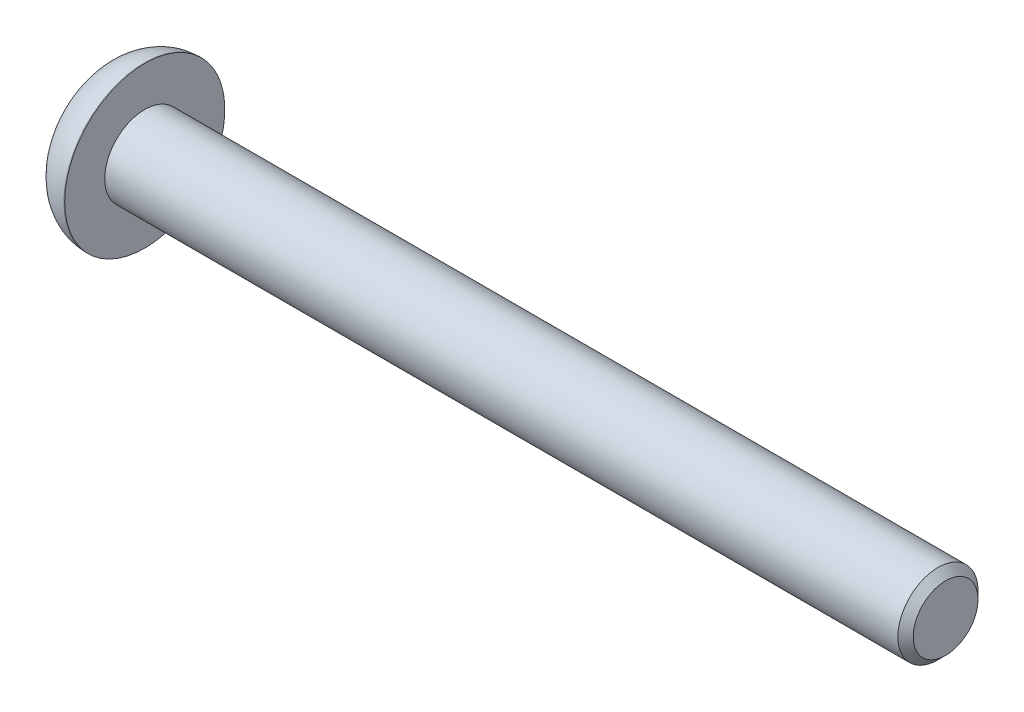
ISO-10303-21;
HEADER;
FILE_DESCRIPTION(('STEP AP214'),'2;1');
FILE_NAME('part.step','',(''),(''),'','','');
FILE_SCHEMA(('AUTOMOTIVE_DESIGN { 1 0 10303 214 1 1 1 1 }'));
ENDSEC;
DATA;
#1=APPLICATION_CONTEXT('core data for automotive mechanical design processes');
#2=APPLICATION_PROTOCOL_DEFINITION('international standard','automotive_design',2000,#1);
#3=PRODUCT_CONTEXT('',#1,'mechanical');
#4=PRODUCT('Part','Part','',(#3));
#5=PRODUCT_RELATED_PRODUCT_CATEGORY('part','',(#4));
#6=PRODUCT_DEFINITION_FORMATION('','',#4);
#7=PRODUCT_DEFINITION_CONTEXT('part definition',#1,'design');
#8=PRODUCT_DEFINITION('design','',#6,#7);
#9=PRODUCT_DEFINITION_SHAPE('','',#8);
#10=(LENGTH_UNIT() NAMED_UNIT(*) SI_UNIT(.MILLI.,.METRE.));
#11=(NAMED_UNIT(*) PLANE_ANGLE_UNIT() SI_UNIT($,.RADIAN.));
#12=(NAMED_UNIT(*) SI_UNIT($,.STERADIAN.) SOLID_ANGLE_UNIT());
#13=UNCERTAINTY_MEASURE_WITH_UNIT(LENGTH_MEASURE(1.E-05),#10,'distance_accuracy_value','');
#14=(GEOMETRIC_REPRESENTATION_CONTEXT(3) GLOBAL_UNCERTAINTY_ASSIGNED_CONTEXT((#13)) GLOBAL_UNIT_ASSIGNED_CONTEXT((#10,
#11,#12)) REPRESENTATION_CONTEXT('',''));
#15=CARTESIAN_POINT('',(0.,0.,0.));
#16=DIRECTION('',(0.,0.,1.));
#17=DIRECTION('',(1.,0.,0.));
#18=AXIS2_PLACEMENT_3D('',#15,#16,#17);
#19=CARTESIAN_POINT('',(2.86,0.,0.));
#20=DIRECTION('',(1.,0.,0.));
#21=DIRECTION('',(0.,0.,-1.));
#22=AXIS2_PLACEMENT_3D('',#19,#20,#21);
#23=PLANE('',#22);
#24=DIRECTION('',(0.,1.,0.));
#25=VECTOR('',#24,1.);
#26=CARTESIAN_POINT('',(2.86,0.,-2.5));
#27=LINE('',#26,#25);
#28=CARTESIAN_POINT('',(2.86,-1.44337567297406,-2.5));
#29=VERTEX_POINT('',#28);
#30=CARTESIAN_POINT('',(2.86,0.,-2.5));
#31=VERTEX_POINT('',#30);
#32=EDGE_CURVE('E83',#29,#31,#27,.T.);
#33=ORIENTED_EDGE('',*,*,#32,.F.);
#34=DIRECTION('',(0.,0.5,-0.866025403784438));
#35=VECTOR('',#34,1.);
#36=CARTESIAN_POINT('',(2.86,-2.1650635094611,-1.25));
#37=LINE('',#36,#35);
#38=CARTESIAN_POINT('',(2.86,-2.1650635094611,-1.25));
#39=VERTEX_POINT('',#38);
#40=EDGE_CURVE('E106',#39,#29,#37,.T.);
#41=ORIENTED_EDGE('',*,*,#40,.F.);
#42=CARTESIAN_POINT('',(2.86,0.,0.));
#43=DIRECTION('',(-1.,0.,0.));
#44=DIRECTION('',(0.,0.,1.));
#45=AXIS2_PLACEMENT_3D('',#42,#43,#44);
#46=CIRCLE('',#45,2.5);
#47=EDGE_CURVE('E113',#39,#31,#46,.F.);
#48=ORIENTED_EDGE('',*,*,#47,.T.);
#49=EDGE_LOOP('',(#33,#41,#48));
#50=FACE_BOUND('',#49,.T.);
#51=ADVANCED_FACE('F17',(#50),#23,.F.);
#52=CARTESIAN_POINT('',(2.86,0.,0.));
#53=DIRECTION('',(1.,0.,0.));
#54=DIRECTION('',(0.,0.,-1.));
#55=AXIS2_PLACEMENT_3D('',#52,#53,#54);
#56=PLANE('',#55);
#57=DIRECTION('',(0.,0.5,0.866025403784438));
#58=VECTOR('',#57,1.);
#59=CARTESIAN_POINT('',(2.86,1.44337567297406,-2.5));
#60=LINE('',#59,#58);
#61=CARTESIAN_POINT('',(2.86,1.44337567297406,-2.5));
#62=VERTEX_POINT('',#61);
#63=CARTESIAN_POINT('',(2.86,2.1650635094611,-1.25));
#64=VERTEX_POINT('',#63);
#65=EDGE_CURVE('E121',#62,#64,#60,.T.);
#66=ORIENTED_EDGE('',*,*,#65,.F.);
#67=DIRECTION('',(0.,1.,0.));
#68=VECTOR('',#67,1.);
#69=CARTESIAN_POINT('',(2.86,0.,-2.5));
#70=LINE('',#69,#68);
#71=EDGE_CURVE('E126',#31,#62,#70,.T.);
#72=ORIENTED_EDGE('',*,*,#71,.F.);
#73=CARTESIAN_POINT('',(2.86,0.,0.));
#74=DIRECTION('',(-1.,0.,0.));
#75=DIRECTION('',(0.,0.,1.));
#76=AXIS2_PLACEMENT_3D('',#73,#74,#75);
#77=CIRCLE('',#76,2.5);
#78=EDGE_CURVE('E120',#31,#64,#77,.F.);
#79=ORIENTED_EDGE('',*,*,#78,.T.);
#80=EDGE_LOOP('',(#66,#72,#79));
#81=FACE_BOUND('',#80,.T.);
#82=ADVANCED_FACE('F457',(#81),#56,.F.);
#83=CARTESIAN_POINT('',(2.86,0.,0.));
#84=DIRECTION('',(1.,0.,0.));
#85=DIRECTION('',(0.,0.,-1.));
#86=AXIS2_PLACEMENT_3D('',#83,#84,#85);
#87=PLANE('',#86);
#88=DIRECTION('',(0.,1.,0.));
#89=VECTOR('',#88,1.);
#90=CARTESIAN_POINT('',(2.86,0.,2.5));
#91=LINE('',#90,#89);
#92=CARTESIAN_POINT('',(2.86,1.44337567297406,2.5));
#93=VERTEX_POINT('',#92);
#94=CARTESIAN_POINT('',(2.86,0.,2.5));
#95=VERTEX_POINT('',#94);
#96=EDGE_CURVE('E251',#93,#95,#91,.F.);
#97=ORIENTED_EDGE('',*,*,#96,.F.);
#98=DIRECTION('',(0.,-0.5,0.866025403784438));
#99=VECTOR('',#98,1.);
#100=CARTESIAN_POINT('',(2.86,2.1650635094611,1.25));
#101=LINE('',#100,#99);
#102=CARTESIAN_POINT('',(2.86,2.1650635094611,1.25));
#103=VERTEX_POINT('',#102);
#104=EDGE_CURVE('E123',#103,#93,#101,.T.);
#105=ORIENTED_EDGE('',*,*,#104,.F.);
#106=CARTESIAN_POINT('',(2.86,0.,0.));
#107=DIRECTION('',(-1.,0.,0.));
#108=DIRECTION('',(0.,0.,1.));
#109=AXIS2_PLACEMENT_3D('',#106,#107,#108);
#110=CIRCLE('',#109,2.5);
#111=EDGE_CURVE('E99',#103,#95,#110,.F.);
#112=ORIENTED_EDGE('',*,*,#111,.T.);
#113=EDGE_LOOP('',(#97,#105,#112));
#114=FACE_BOUND('',#113,.T.);
#115=ADVANCED_FACE('F303',(#114),#87,.F.);
#116=CARTESIAN_POINT('',(2.95662432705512,0.,0.));
#117=DIRECTION('',(-1.,0.,0.));
#118=DIRECTION('',(0.,0.,1.));
#119=AXIS2_PLACEMENT_3D('',#116,#117,#118);
#120=CONICAL_SURFACE('',#119,2.49999999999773,1.0471975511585);
#121=CARTESIAN_POINT('',(2.95662432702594,0.,0.));
#122=DIRECTION('',(-1.,0.,0.));
#123=DIRECTION('',(0.,0.,1.));
#124=AXIS2_PLACEMENT_3D('',#121,#122,#123);
#125=CIRCLE('',#124,2.5);
#126=CARTESIAN_POINT('',(2.95662432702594,0.,2.5));
#127=VERTEX_POINT('',#126);
#128=EDGE_CURVE('E98',#127,#127,#125,.T.);
#129=ORIENTED_EDGE('',*,*,#128,.T.);
#130=EDGE_LOOP('',(#129));
#131=FACE_BOUND('',#130,.T.);
#132=CARTESIAN_POINT('',(4.40000000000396,2.8421709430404E-11,0.));
#133=VERTEX_POINT('',#132);
#134=VERTEX_LOOP('',#133);
#135=FACE_BOUND('',#134,.T.);
#136=ADVANCED_FACE('F443',(#131,#135),#120,.F.);
#137=CARTESIAN_POINT('',(1.47831216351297,0.,0.));
#138=DIRECTION('',(-1.,0.,0.));
#139=DIRECTION('',(0.,0.,1.));
#140=AXIS2_PLACEMENT_3D('',#137,#138,#139);
#141=CYLINDRICAL_SURFACE('',#140,2.5);
#142=ORIENTED_EDGE('',*,*,#47,.F.);
#143=CARTESIAN_POINT('',(2.86,0.,0.));
#144=DIRECTION('',(-1.,0.,0.));
#145=DIRECTION('',(0.,0.,1.));
#146=AXIS2_PLACEMENT_3D('',#143,#144,#145);
#147=CIRCLE('',#146,2.5);
#148=CARTESIAN_POINT('',(2.86,-2.1650635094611,1.25));
#149=VERTEX_POINT('',#148);
#150=EDGE_CURVE('E88',#149,#39,#147,.F.);
#151=ORIENTED_EDGE('',*,*,#150,.F.);
#152=CARTESIAN_POINT('',(2.86,0.,0.));
#153=DIRECTION('',(-1.,0.,0.));
#154=DIRECTION('',(0.,0.,1.));
#155=AXIS2_PLACEMENT_3D('',#152,#153,#154);
#156=CIRCLE('',#155,2.5);
#157=EDGE_CURVE('E244',#149,#95,#156,.T.);
#158=ORIENTED_EDGE('',*,*,#157,.T.);
#159=ORIENTED_EDGE('',*,*,#111,.F.);
#160=CARTESIAN_POINT('',(2.86,0.,0.));
#161=DIRECTION('',(-1.,0.,0.));
#162=DIRECTION('',(0.,0.,1.));
#163=AXIS2_PLACEMENT_3D('',#160,#161,#162);
#164=CIRCLE('',#163,2.5);
#165=EDGE_CURVE('E253',#64,#103,#164,.F.);
#166=ORIENTED_EDGE('',*,*,#165,.F.);
#167=ORIENTED_EDGE('',*,*,#78,.F.);
#168=EDGE_LOOP('',(#142,#151,#158,#159,#166,#167));
#169=FACE_BOUND('',#168,.T.);
#170=ORIENTED_EDGE('',*,*,#128,.F.);
#171=EDGE_LOOP('',(#170));
#172=FACE_BOUND('',#171,.T.);
#173=ADVANCED_FACE('F117',(#169,#172),#141,.F.);
#174=CARTESIAN_POINT('',(2.86,0.,0.));
#175=DIRECTION('',(1.,0.,0.));
#176=DIRECTION('',(0.,0.,-1.));
#177=AXIS2_PLACEMENT_3D('',#174,#175,#176);
#178=PLANE('',#177);
#179=DIRECTION('',(0.,-0.5,-0.866025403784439));
#180=VECTOR('',#179,1.);
#181=CARTESIAN_POINT('',(2.86,-2.88675134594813,0.));
#182=LINE('',#181,#180);
#183=CARTESIAN_POINT('',(2.86,-1.44337567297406,2.5));
#184=VERTEX_POINT('',#183);
#185=EDGE_CURVE('E232',#149,#184,#182,.F.);
#186=ORIENTED_EDGE('',*,*,#185,.T.);
#187=DIRECTION('',(0.,1.,0.));
#188=VECTOR('',#187,1.);
#189=CARTESIAN_POINT('',(2.86,-1.44337567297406,2.5));
#190=LINE('',#189,#188);
#191=EDGE_CURVE('E233',#184,#95,#190,.T.);
#192=ORIENTED_EDGE('',*,*,#191,.T.);
#193=ORIENTED_EDGE('',*,*,#157,.F.);
#194=EDGE_LOOP('',(#186,#192,#193));
#195=FACE_BOUND('',#194,.T.);
#196=ADVANCED_FACE('F307',(#195),#178,.F.);
#197=CARTESIAN_POINT('',(2.86,0.,0.));
#198=DIRECTION('',(1.,0.,0.));
#199=DIRECTION('',(0.,0.,-1.));
#200=AXIS2_PLACEMENT_3D('',#197,#198,#199);
#201=PLANE('',#200);
#202=DIRECTION('',(0.,0.5,-0.866025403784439));
#203=VECTOR('',#202,1.);
#204=CARTESIAN_POINT('',(2.86,-1.44337567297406,-2.5));
#205=LINE('',#204,#203);
#206=CARTESIAN_POINT('',(2.86,-2.88675134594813,0.));
#207=VERTEX_POINT('',#206);
#208=EDGE_CURVE('E91',#39,#207,#205,.F.);
#209=ORIENTED_EDGE('',*,*,#208,.T.);
#210=DIRECTION('',(0.,-0.5,-0.866025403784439));
#211=VECTOR('',#210,1.);
#212=CARTESIAN_POINT('',(2.86,-2.88675134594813,0.));
#213=LINE('',#212,#211);
#214=EDGE_CURVE('E93',#207,#149,#213,.F.);
#215=ORIENTED_EDGE('',*,*,#214,.T.);
#216=ORIENTED_EDGE('',*,*,#150,.T.);
#217=EDGE_LOOP('',(#209,#215,#216));
#218=FACE_BOUND('',#217,.T.);
#219=ADVANCED_FACE('F90',(#218),#201,.F.);
#220=CARTESIAN_POINT('',(2.86,0.,0.));
#221=DIRECTION('',(1.,0.,0.));
#222=DIRECTION('',(0.,0.,-1.));
#223=AXIS2_PLACEMENT_3D('',#220,#221,#222);
#224=PLANE('',#223);
#225=DIRECTION('',(0.,-0.5,0.866025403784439));
#226=VECTOR('',#225,1.);
#227=CARTESIAN_POINT('',(2.86,1.44337567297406,2.5));
#228=LINE('',#227,#226);
#229=CARTESIAN_POINT('',(2.86,2.88675134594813,0.));
#230=VERTEX_POINT('',#229);
#231=EDGE_CURVE('E208',#103,#230,#228,.F.);
#232=ORIENTED_EDGE('',*,*,#231,.T.);
#233=DIRECTION('',(0.,0.5,0.866025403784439));
#234=VECTOR('',#233,1.);
#235=CARTESIAN_POINT('',(2.86,2.88675134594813,0.));
#236=LINE('',#235,#234);
#237=EDGE_CURVE('E218',#230,#64,#236,.F.);
#238=ORIENTED_EDGE('',*,*,#237,.T.);
#239=ORIENTED_EDGE('',*,*,#165,.T.);
#240=EDGE_LOOP('',(#232,#238,#239));
#241=FACE_BOUND('',#240,.T.);
#242=ADVANCED_FACE('F292',(#241),#224,.F.);
#243=CARTESIAN_POINT('',(0.,-1.44337567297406,2.5));
#244=DIRECTION('',(0.,0.,1.));
#245=DIRECTION('',(1.,0.,0.));
#246=AXIS2_PLACEMENT_3D('',#243,#244,#245);
#247=PLANE('',#246);
#248=DIRECTION('',(1.,0.,0.));
#249=VECTOR('',#248,1.);
#250=CARTESIAN_POINT('',(0.,1.44337567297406,2.5));
#251=LINE('',#250,#249);
#252=CARTESIAN_POINT('',(0.,1.44337567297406,2.5));
#253=VERTEX_POINT('',#252);
#254=EDGE_CURVE('E215',#253,#93,#251,.T.);
#255=ORIENTED_EDGE('',*,*,#254,.T.);
#256=ORIENTED_EDGE('',*,*,#96,.T.);
#257=ORIENTED_EDGE('',*,*,#191,.F.);
#258=DIRECTION('',(1.,0.,0.));
#259=VECTOR('',#258,1.);
#260=CARTESIAN_POINT('',(0.,-1.44337567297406,2.5));
#261=LINE('',#260,#259);
#262=CARTESIAN_POINT('',(0.,-1.44337567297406,2.5));
#263=VERTEX_POINT('',#262);
#264=EDGE_CURVE('E110',#184,#263,#261,.F.);
#265=ORIENTED_EDGE('',*,*,#264,.T.);
#266=DIRECTION('',(0.,1.,0.));
#267=VECTOR('',#266,1.);
#268=CARTESIAN_POINT('',(0.,1.84,2.5));
#269=LINE('',#268,#267);
#270=EDGE_CURVE('E201',#253,#263,#269,.F.);
#271=ORIENTED_EDGE('',*,*,#270,.F.);
#272=EDGE_LOOP('',(#255,#256,#257,#265,#271));
#273=FACE_BOUND('',#272,.T.);
#274=ADVANCED_FACE('F310',(#273),#247,.F.);
#275=CARTESIAN_POINT('',(0.,-2.88675134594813,0.));
#276=DIRECTION('',(0.,-0.866025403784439,0.5));
#277=DIRECTION('',(0.,-0.5,-0.866025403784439));
#278=AXIS2_PLACEMENT_3D('',#275,#276,#277);
#279=PLANE('',#278);
#280=ORIENTED_EDGE('',*,*,#264,.F.);
#281=ORIENTED_EDGE('',*,*,#185,.F.);
#282=ORIENTED_EDGE('',*,*,#214,.F.);
#283=DIRECTION('',(1.,0.,0.));
#284=VECTOR('',#283,1.);
#285=CARTESIAN_POINT('',(0.,-2.88675134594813,0.));
#286=LINE('',#285,#284);
#287=CARTESIAN_POINT('',(0.,-2.88675134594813,0.));
#288=VERTEX_POINT('',#287);
#289=EDGE_CURVE('E109',#207,#288,#286,.F.);
#290=ORIENTED_EDGE('',*,*,#289,.T.);
#291=DIRECTION('',(0.,-0.5,-0.866025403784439));
#292=VECTOR('',#291,1.);
#293=CARTESIAN_POINT('',(0.,-1.44337567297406,2.5));
#294=LINE('',#293,#292);
#295=EDGE_CURVE('E198',#263,#288,#294,.T.);
#296=ORIENTED_EDGE('',*,*,#295,.F.);
#297=EDGE_LOOP('',(#280,#281,#282,#290,#296));
#298=FACE_BOUND('',#297,.T.);
#299=ADVANCED_FACE('F315',(#298),#279,.F.);
#300=CARTESIAN_POINT('',(0.,-1.44337567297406,-2.5));
#301=DIRECTION('',(0.,-0.866025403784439,-0.5));
#302=DIRECTION('',(0.,0.5,-0.866025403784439));
#303=AXIS2_PLACEMENT_3D('',#300,#301,#302);
#304=PLANE('',#303);
#305=ORIENTED_EDGE('',*,*,#289,.F.);
#306=ORIENTED_EDGE('',*,*,#208,.F.);
#307=ORIENTED_EDGE('',*,*,#40,.T.);
#308=DIRECTION('',(-1.,0.,0.));
#309=VECTOR('',#308,1.);
#310=CARTESIAN_POINT('',(0.,-1.44337567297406,-2.5));
#311=LINE('',#310,#309);
#312=CARTESIAN_POINT('',(0.,-1.44337567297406,-2.5));
#313=VERTEX_POINT('',#312);
#314=EDGE_CURVE('E222',#29,#313,#311,.T.);
#315=ORIENTED_EDGE('',*,*,#314,.T.);
#316=DIRECTION('',(0.,0.5,-0.866025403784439));
#317=VECTOR('',#316,1.);
#318=CARTESIAN_POINT('',(0.,-2.88675134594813,0.));
#319=LINE('',#318,#317);
#320=EDGE_CURVE('E195',#288,#313,#319,.T.);
#321=ORIENTED_EDGE('',*,*,#320,.F.);
#322=EDGE_LOOP('',(#305,#306,#307,#315,#321));
#323=FACE_BOUND('',#322,.T.);
#324=ADVANCED_FACE('F104',(#323),#304,.F.);
#325=CARTESIAN_POINT('',(0.,1.44337567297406,-2.5));
#326=DIRECTION('',(0.,0.,-1.));
#327=DIRECTION('',(-1.,0.,0.));
#328=AXIS2_PLACEMENT_3D('',#325,#326,#327);
#329=PLANE('',#328);
#330=ORIENTED_EDGE('',*,*,#314,.F.);
#331=ORIENTED_EDGE('',*,*,#32,.T.);
#332=ORIENTED_EDGE('',*,*,#71,.T.);
#333=DIRECTION('',(1.,0.,0.));
#334=VECTOR('',#333,1.);
#335=CARTESIAN_POINT('',(0.,1.44337567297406,-2.5));
#336=LINE('',#335,#334);
#337=CARTESIAN_POINT('',(0.,1.44337567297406,-2.5));
#338=VERTEX_POINT('',#337);
#339=EDGE_CURVE('E221',#62,#338,#336,.F.);
#340=ORIENTED_EDGE('',*,*,#339,.T.);
#341=DIRECTION('',(0.,1.,0.));
#342=VECTOR('',#341,1.);
#343=CARTESIAN_POINT('',(0.,1.84,-2.5));
#344=LINE('',#343,#342);
#345=EDGE_CURVE('E192',#313,#338,#344,.T.);
#346=ORIENTED_EDGE('',*,*,#345,.F.);
#347=EDGE_LOOP('',(#330,#331,#332,#340,#346));
#348=FACE_BOUND('',#347,.T.);
#349=ADVANCED_FACE('F333',(#348),#329,.F.);
#350=CARTESIAN_POINT('',(0.,2.88675134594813,0.));
#351=DIRECTION('',(0.,0.866025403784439,-0.5));
#352=DIRECTION('',(0.,0.5,0.866025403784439));
#353=AXIS2_PLACEMENT_3D('',#350,#351,#352);
#354=PLANE('',#353);
#355=ORIENTED_EDGE('',*,*,#339,.F.);
#356=ORIENTED_EDGE('',*,*,#65,.T.);
#357=ORIENTED_EDGE('',*,*,#237,.F.);
#358=DIRECTION('',(1.,0.,0.));
#359=VECTOR('',#358,1.);
#360=CARTESIAN_POINT('',(0.,2.88675134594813,0.));
#361=LINE('',#360,#359);
#362=CARTESIAN_POINT('',(0.,2.88675134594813,0.));
#363=VERTEX_POINT('',#362);
#364=EDGE_CURVE('E204',#230,#363,#361,.F.);
#365=ORIENTED_EDGE('',*,*,#364,.T.);
#366=DIRECTION('',(0.,0.5,0.866025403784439));
#367=VECTOR('',#366,1.);
#368=CARTESIAN_POINT('',(0.,1.44337567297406,-2.5));
#369=LINE('',#368,#367);
#370=EDGE_CURVE('E189',#338,#363,#369,.T.);
#371=ORIENTED_EDGE('',*,*,#370,.F.);
#372=EDGE_LOOP('',(#355,#356,#357,#365,#371));
#373=FACE_BOUND('',#372,.T.);
#374=ADVANCED_FACE('F327',(#373),#354,.F.);
#375=CARTESIAN_POINT('',(0.,1.44337567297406,2.5));
#376=DIRECTION('',(0.,0.866025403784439,0.5));
#377=DIRECTION('',(0.,-0.5,0.866025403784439));
#378=AXIS2_PLACEMENT_3D('',#375,#376,#377);
#379=PLANE('',#378);
#380=ORIENTED_EDGE('',*,*,#364,.F.);
#381=ORIENTED_EDGE('',*,*,#231,.F.);
#382=ORIENTED_EDGE('',*,*,#104,.T.);
#383=ORIENTED_EDGE('',*,*,#254,.F.);
#384=DIRECTION('',(0.,-0.5,0.866025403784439));
#385=VECTOR('',#384,1.);
#386=CARTESIAN_POINT('',(0.,2.88675134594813,0.));
#387=LINE('',#386,#385);
#388=EDGE_CURVE('E181',#363,#253,#387,.T.);
#389=ORIENTED_EDGE('',*,*,#388,.F.);
#390=EDGE_LOOP('',(#380,#381,#382,#383,#389));
#391=FACE_BOUND('',#390,.T.);
#392=ADVANCED_FACE('F298',(#391),#379,.F.);
#393=CARTESIAN_POINT('',(0.,1.84,0.));
#394=DIRECTION('',(-1.,0.,0.));
#395=DIRECTION('',(0.,0.,1.));
#396=AXIS2_PLACEMENT_3D('',#393,#394,#395);
#397=PLANE('',#396);
#398=CARTESIAN_POINT('',(0.,0.,0.));
#399=DIRECTION('',(1.,0.,0.));
#400=DIRECTION('',(0.,0.,1.));
#401=AXIS2_PLACEMENT_3D('',#398,#399,#400);
#402=CIRCLE('',#401,3.68);
#403=CARTESIAN_POINT('',(0.,0.,3.68));
#404=VERTEX_POINT('',#403);
#405=CARTESIAN_POINT('',(0.,0.,-3.68));
#406=VERTEX_POINT('',#405);
#407=EDGE_CURVE('E167',#404,#406,#402,.T.);
#408=ORIENTED_EDGE('',*,*,#407,.F.);
#409=CARTESIAN_POINT('',(0.,0.,0.));
#410=DIRECTION('',(1.,0.,0.));
#411=DIRECTION('',(0.,1.,0.));
#412=AXIS2_PLACEMENT_3D('',#409,#410,#411);
#413=CIRCLE('',#412,3.68);
#414=CARTESIAN_POINT('',(0.,3.68,0.));
#415=VERTEX_POINT('',#414);
#416=EDGE_CURVE('E177',#415,#404,#413,.T.);
#417=ORIENTED_EDGE('',*,*,#416,.F.);
#418=CARTESIAN_POINT('',(0.,0.,0.));
#419=DIRECTION('',(1.,0.,0.));
#420=DIRECTION('',(0.,0.,-1.));
#421=AXIS2_PLACEMENT_3D('',#418,#419,#420);
#422=CIRCLE('',#421,3.68);
#423=EDGE_CURVE('E37',#406,#415,#422,.T.);
#424=ORIENTED_EDGE('',*,*,#423,.F.);
#425=EDGE_LOOP('',(#408,#417,#424));
#426=FACE_BOUND('',#425,.T.);
#427=ORIENTED_EDGE('',*,*,#370,.T.);
#428=ORIENTED_EDGE('',*,*,#388,.T.);
#429=ORIENTED_EDGE('',*,*,#270,.T.);
#430=ORIENTED_EDGE('',*,*,#295,.T.);
#431=ORIENTED_EDGE('',*,*,#320,.T.);
#432=ORIENTED_EDGE('',*,*,#345,.T.);
#433=EDGE_LOOP('',(#427,#428,#429,#430,#431,#432));
#434=FACE_BOUND('',#433,.T.);
#435=ADVANCED_FACE('F146',(#426,#434),#397,.T.);
#436=CARTESIAN_POINT('',(4.32,0.,3.68));
#437=DIRECTION('',(0.,1.,0.));
#438=DIRECTION('',(0.,0.,1.));
#439=AXIS2_PLACEMENT_3D('',#436,#437,#438);
#440=CIRCLE('',#439,4.32);
#441=TRIMMED_CURVE('',#440,(PARAMETER_VALUE(-2.59030705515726)),
(PARAMETER_VALUE(2.59030705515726)),.T.,.PARAMETER.);
#442=CARTESIAN_POINT('',(4.32,0.,0.));
#443=DIRECTION('',(-1.,0.,0.));
#444=AXIS1_PLACEMENT('',#442,#443);
#445=SURFACE_OF_REVOLUTION('',#441,#444);
#446=ORIENTED_EDGE('',*,*,#416,.T.);
#447=ORIENTED_EDGE('',*,*,#407,.T.);
#448=ORIENTED_EDGE('',*,*,#423,.T.);
#449=EDGE_LOOP('',(#446,#447,#448));
#450=FACE_BOUND('',#449,.T.);
#451=CARTESIAN_POINT('',(4.32,0.,0.));
#452=DIRECTION('',(-1.,0.,0.));
#453=DIRECTION('',(0.,0.,1.));
#454=AXIS2_PLACEMENT_3D('',#451,#452,#453);
#455=CIRCLE('',#454,8.);
#456=CARTESIAN_POINT('',(4.32,0.,8.));
#457=VERTEX_POINT('',#456);
#458=EDGE_CURVE('E155',#457,#457,#455,.F.);
#459=ORIENTED_EDGE('',*,*,#458,.F.);
#460=EDGE_LOOP('',(#459));
#461=FACE_BOUND('',#460,.T.);
#462=ADVANCED_FACE('F134',(#450,#461),#445,.F.);
#463=CARTESIAN_POINT('',(84.4,1.6165,0.));
#464=DIRECTION('',(1.,0.,0.));
#465=DIRECTION('',(0.,0.,-1.));
#466=AXIS2_PLACEMENT_3D('',#463,#464,#465);
#467=PLANE('',#466);
#468=CARTESIAN_POINT('',(84.4000000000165,0.,0.));
#469=DIRECTION('',(-1.,0.,0.));
#470=DIRECTION('',(0.,0.,1.));
#471=AXIS2_PLACEMENT_3D('',#468,#469,#470);
#472=CIRCLE('',#471,3.23300000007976);
#473=CARTESIAN_POINT('',(84.4000000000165,0.,3.23300000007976));
#474=VERTEX_POINT('',#473);
#475=EDGE_CURVE('E285',#474,#474,#472,.T.);
#476=ORIENTED_EDGE('',*,*,#475,.F.);
#477=EDGE_LOOP('',(#476));
#478=FACE_BOUND('',#477,.T.);
#479=ADVANCED_FACE('F145',(#478),#467,.T.);
#480=CARTESIAN_POINT('',(4.36,0.,0.));
#481=DIRECTION('',(-1.,0.,0.));
#482=DIRECTION('',(0.,0.,1.));
#483=AXIS2_PLACEMENT_3D('',#480,#481,#482);
#484=CYLINDRICAL_SURFACE('',#483,8.);
#485=ORIENTED_EDGE('',*,*,#458,.T.);
#486=EDGE_LOOP('',(#485));
#487=FACE_BOUND('',#486,.T.);
#488=CARTESIAN_POINT('',(4.4,0.,0.));
#489=DIRECTION('',(-1.,0.,0.));
#490=DIRECTION('',(0.,0.,1.));
#491=AXIS2_PLACEMENT_3D('',#488,#489,#490);
#492=CIRCLE('',#491,8.);
#493=CARTESIAN_POINT('',(4.4,0.,8.));
#494=VERTEX_POINT('',#493);
#495=EDGE_CURVE('E282',#494,#494,#492,.F.);
#496=ORIENTED_EDGE('',*,*,#495,.F.);
#497=EDGE_LOOP('',(#496));
#498=FACE_BOUND('',#497,.T.);
#499=ADVANCED_FACE('F358',(#487,#498),#484,.T.);
#500=CARTESIAN_POINT('',(83.633000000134,0.,0.));
#501=DIRECTION('',(-1.,0.,0.));
#502=DIRECTION('',(0.,0.,1.));
#503=AXIS2_PLACEMENT_3D('',#500,#501,#502);
#504=CONICAL_SURFACE('',#503,4.0000000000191,0.785398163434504);
#505=ORIENTED_EDGE('',*,*,#475,.T.);
#506=EDGE_LOOP('',(#505));
#507=FACE_BOUND('',#506,.T.);
#508=CARTESIAN_POINT('',(83.633,0.,0.));
#509=DIRECTION('',(-1.,0.,0.));
#510=DIRECTION('',(0.,0.,1.));
#511=AXIS2_PLACEMENT_3D('',#508,#509,#510);
#512=CIRCLE('',#511,4.);
#513=CARTESIAN_POINT('',(83.633,0.,4.));
#514=VERTEX_POINT('',#513);
#515=EDGE_CURVE('E28',#514,#514,#512,.T.);
#516=ORIENTED_EDGE('',*,*,#515,.F.);
#517=EDGE_LOOP('',(#516));
#518=FACE_BOUND('',#517,.T.);
#519=ADVANCED_FACE('F351',(#507,#518),#504,.T.);
#520=CARTESIAN_POINT('',(4.4,6.,0.));
#521=DIRECTION('',(1.,0.,0.));
#522=DIRECTION('',(0.,0.,-1.));
#523=AXIS2_PLACEMENT_3D('',#520,#521,#522);
#524=PLANE('',#523);
#525=CARTESIAN_POINT('',(4.4,0.,0.));
#526=DIRECTION('',(-1.,0.,0.));
#527=DIRECTION('',(0.,0.,1.));
#528=AXIS2_PLACEMENT_3D('',#525,#526,#527);
#529=CIRCLE('',#528,4.);
#530=CARTESIAN_POINT('',(4.4,0.,4.));
#531=VERTEX_POINT('',#530);
#532=EDGE_CURVE('E11',#531,#531,#529,.F.);
#533=ORIENTED_EDGE('',*,*,#532,.F.);
#534=EDGE_LOOP('',(#533));
#535=FACE_BOUND('',#534,.T.);
#536=ORIENTED_EDGE('',*,*,#495,.T.);
#537=EDGE_LOOP('',(#536));
#538=FACE_BOUND('',#537,.T.);
#539=ADVANCED_FACE('F345',(#535,#538),#524,.T.);
#540=CARTESIAN_POINT('',(44.0165,0.,0.));
#541=DIRECTION('',(-1.,0.,0.));
#542=DIRECTION('',(0.,0.,1.));
#543=AXIS2_PLACEMENT_3D('',#540,#541,#542);
#544=CYLINDRICAL_SURFACE('',#543,4.);
#545=ORIENTED_EDGE('',*,*,#515,.T.);
#546=EDGE_LOOP('',(#545));
#547=FACE_BOUND('',#546,.T.);
#548=ORIENTED_EDGE('',*,*,#532,.T.);
#549=EDGE_LOOP('',(#548));
#550=FACE_BOUND('',#549,.T.);
#551=ADVANCED_FACE('F343',(#547,#550),#544,.T.);
#552=CLOSED_SHELL('',(#51,#82,#115,#136,#173,#196,#219,#242,#274,#299,#324,#349,#374,#392,#435,
#462,#479,#499,#519,#539,#551));
#553=MANIFOLD_SOLID_BREP('B1',#552);
#554=ADVANCED_BREP_SHAPE_REPRESENTATION('',(#18,#553),#14);
#555=SHAPE_DEFINITION_REPRESENTATION(#9,#554);
ENDSEC;
END-ISO-10303-21;
